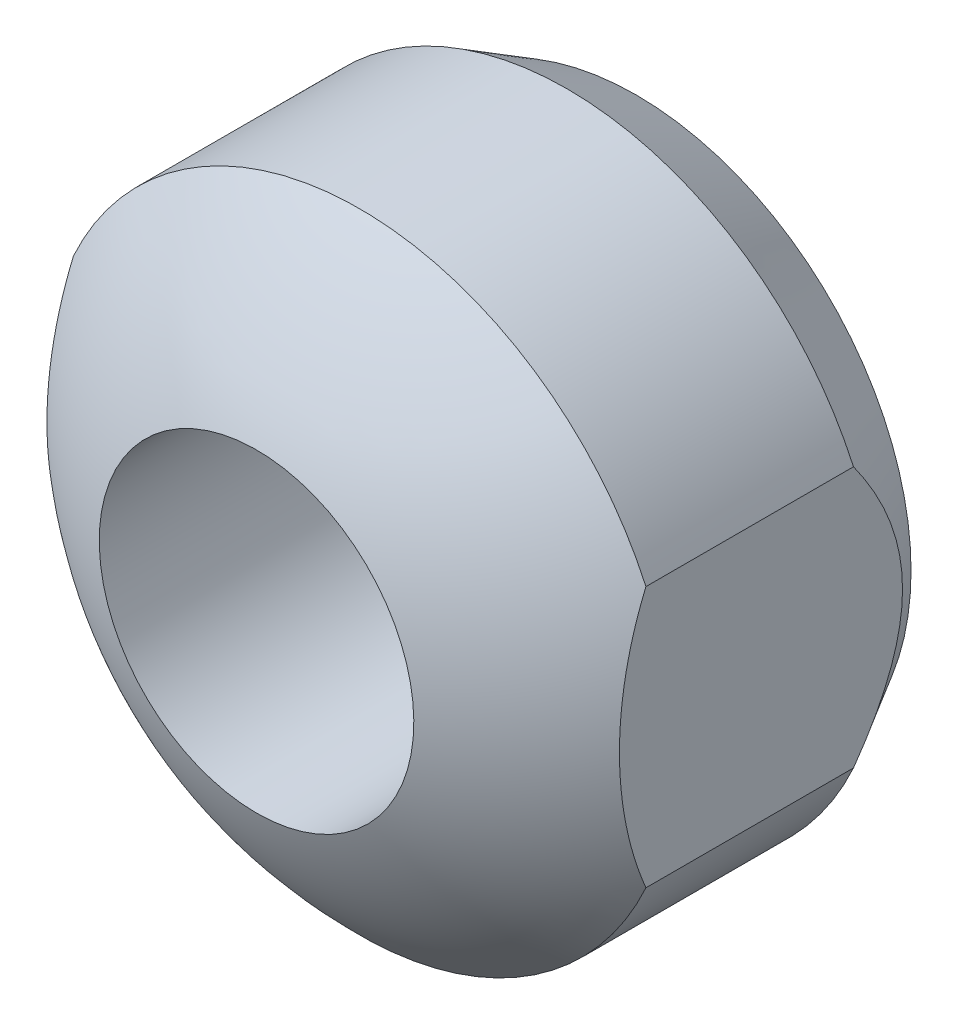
ISO-10303-21;
HEADER;
FILE_DESCRIPTION(('STEP AP214'),'2;1');
FILE_NAME('part.step','',(''),(''),'','','');
FILE_SCHEMA(('AUTOMOTIVE_DESIGN { 1 0 10303 214 1 1 1 1 }'));
ENDSEC;
DATA;
#1=APPLICATION_CONTEXT('core data for automotive mechanical design processes');
#2=APPLICATION_PROTOCOL_DEFINITION('international standard','automotive_design',2000,#1);
#3=PRODUCT_CONTEXT('',#1,'mechanical');
#4=PRODUCT('Part','Part','',(#3));
#5=PRODUCT_RELATED_PRODUCT_CATEGORY('part','',(#4));
#6=PRODUCT_DEFINITION_FORMATION('','',#4);
#7=PRODUCT_DEFINITION_CONTEXT('part definition',#1,'design');
#8=PRODUCT_DEFINITION('design','',#6,#7);
#9=PRODUCT_DEFINITION_SHAPE('','',#8);
#10=(LENGTH_UNIT() NAMED_UNIT(*) SI_UNIT(.MILLI.,.METRE.));
#11=(NAMED_UNIT(*) PLANE_ANGLE_UNIT() SI_UNIT($,.RADIAN.));
#12=(NAMED_UNIT(*) SI_UNIT($,.STERADIAN.) SOLID_ANGLE_UNIT());
#13=UNCERTAINTY_MEASURE_WITH_UNIT(LENGTH_MEASURE(1.E-05),#10,'distance_accuracy_value','');
#14=(GEOMETRIC_REPRESENTATION_CONTEXT(3) GLOBAL_UNCERTAINTY_ASSIGNED_CONTEXT((#13)) GLOBAL_UNIT_ASSIGNED_CONTEXT((#10,
#11,#12)) REPRESENTATION_CONTEXT('',''));
#15=CARTESIAN_POINT('',(0.,0.,0.));
#16=DIRECTION('',(0.,0.,1.));
#17=DIRECTION('',(1.,0.,0.));
#18=AXIS2_PLACEMENT_3D('',#15,#16,#17);
#19=CARTESIAN_POINT('',(-9.27383170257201E-12,0.,-0.999999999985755));
#20=DIRECTION('',(0.,0.,1.));
#21=DIRECTION('',(-1.,0.,0.));
#22=AXIS2_PLACEMENT_3D('',#19,#20,#21);
#23=SPHERICAL_SURFACE('',#22,13.9999999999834);
#24=CARTESIAN_POINT('',(9.1,0.,-0.999999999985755));
#25=DIRECTION('',(-1.,0.,0.));
#26=DIRECTION('',(0.,-1.,0.));
#27=AXIS2_PLACEMENT_3D('',#24,#25,#26);
#28=CIRCLE('',#27,10.6390789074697);
#29=CARTESIAN_POINT('',(9.1,4.14608248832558,8.7979589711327));
#30=VERTEX_POINT('',#29);
#31=CARTESIAN_POINT('',(9.1,-4.14608248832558,8.7979589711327));
#32=VERTEX_POINT('',#31);
#33=EDGE_CURVE('E113',#30,#32,#28,.F.);
#34=ORIENTED_EDGE('',*,*,#33,.F.);
#35=CARTESIAN_POINT('',(0.,0.,8.7979589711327));
#36=DIRECTION('',(0.,0.,1.));
#37=DIRECTION('',(0.,1.,0.));
#38=AXIS2_PLACEMENT_3D('',#35,#36,#37);
#39=CIRCLE('',#38,10.);
#40=CARTESIAN_POINT('',(-9.1,4.14608248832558,8.7979589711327));
#41=VERTEX_POINT('',#40);
#42=EDGE_CURVE('E72',#30,#41,#39,.T.);
#43=ORIENTED_EDGE('',*,*,#42,.T.);
#44=CARTESIAN_POINT('',(-9.1,0.,-0.999999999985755));
#45=DIRECTION('',(1.,0.,0.));
#46=DIRECTION('',(0.,1.,0.));
#47=AXIS2_PLACEMENT_3D('',#44,#45,#46);
#48=CIRCLE('',#47,10.6390789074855);
#49=CARTESIAN_POINT('',(-9.1,-4.14608248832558,8.7979589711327));
#50=VERTEX_POINT('',#49);
#51=EDGE_CURVE('E80',#50,#41,#48,.F.);
#52=ORIENTED_EDGE('',*,*,#51,.F.);
#53=EDGE_CURVE('E84',#50,#32,#39,.T.);
#54=ORIENTED_EDGE('',*,*,#53,.T.);
#55=EDGE_LOOP('',(#34,#43,#52,#54));
#56=FACE_BOUND('',#55,.T.);
#57=CARTESIAN_POINT('',(0.,0.,12.0766968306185));
#58=DIRECTION('',(0.,0.,-1.));
#59=DIRECTION('',(0.,-1.,0.));
#60=AXIS2_PLACEMENT_3D('',#57,#58,#59);
#61=CIRCLE('',#60,5.);
#62=CARTESIAN_POINT('',(0.,-5.,12.0766968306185));
#63=VERTEX_POINT('',#62);
#64=EDGE_CURVE('E73',#63,#63,#61,.T.);
#65=ORIENTED_EDGE('',*,*,#64,.T.);
#66=EDGE_LOOP('',(#65));
#67=FACE_BOUND('',#66,.T.);
#68=ADVANCED_FACE('F14',(#56,#67),#23,.T.);
#69=CARTESIAN_POINT('',(0.,0.,0.));
#70=DIRECTION('',(0.,0.,1.));
#71=DIRECTION('',(0.,1.,0.));
#72=AXIS2_PLACEMENT_3D('',#69,#70,#71);
#73=CYLINDRICAL_SURFACE('',#72,10.);
#74=ORIENTED_EDGE('',*,*,#42,.F.);
#75=DIRECTION('',(0.,0.,1.));
#76=VECTOR('',#75,1.);
#77=CARTESIAN_POINT('',(9.1,4.14608248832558,0.));
#78=LINE('',#77,#76);
#79=CARTESIAN_POINT('',(9.1,4.14608248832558,2.2));
#80=VERTEX_POINT('',#79);
#81=EDGE_CURVE('E60',#30,#80,#78,.F.);
#82=ORIENTED_EDGE('',*,*,#81,.T.);
#83=CARTESIAN_POINT('',(0.,0.,2.2));
#84=DIRECTION('',(0.,0.,1.));
#85=DIRECTION('',(0.,1.,0.));
#86=AXIS2_PLACEMENT_3D('',#83,#84,#85);
#87=CIRCLE('',#86,10.);
#88=CARTESIAN_POINT('',(-9.1,4.14608248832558,2.2));
#89=VERTEX_POINT('',#88);
#90=EDGE_CURVE('E71',#80,#89,#87,.T.);
#91=ORIENTED_EDGE('',*,*,#90,.T.);
#92=DIRECTION('',(0.,0.,1.));
#93=VECTOR('',#92,1.);
#94=CARTESIAN_POINT('',(-9.1,4.14608248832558,0.));
#95=LINE('',#94,#93);
#96=EDGE_CURVE('E116',#89,#41,#95,.T.);
#97=ORIENTED_EDGE('',*,*,#96,.T.);
#98=EDGE_LOOP('',(#74,#82,#91,#97));
#99=FACE_BOUND('',#98,.T.);
#100=ADVANCED_FACE('F69',(#99),#73,.T.);
#101=CARTESIAN_POINT('',(0.,0.,2.2));
#102=DIRECTION('',(0.,0.,1.));
#103=DIRECTION('',(0.,1.,0.));
#104=AXIS2_PLACEMENT_3D('',#101,#102,#103);
#105=CONICAL_SURFACE('',#104,10.,0.523598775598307);
#106=CARTESIAN_POINT('',(0.,0.,0.));
#107=DIRECTION('',(0.,0.,1.));
#108=DIRECTION('',(0.,1.,0.));
#109=AXIS2_PLACEMENT_3D('',#106,#107,#108);
#110=CIRCLE('',#109,8.7298294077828);
#111=CARTESIAN_POINT('',(0.,8.7298294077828,0.));
#112=VERTEX_POINT('',#111);
#113=EDGE_CURVE('E77',#112,#112,#110,.T.);
#114=ORIENTED_EDGE('',*,*,#113,.T.);
#115=EDGE_LOOP('',(#114));
#116=FACE_BOUND('',#115,.T.);
#117=ORIENTED_EDGE('',*,*,#90,.F.);
#118=CARTESIAN_POINT('',(9.1,-7.1979788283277,4.97582735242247));
#119=CARTESIAN_POINT('',(9.1,-7.05743173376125,4.82483148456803));
#120=CARTESIAN_POINT('',(9.1,-6.91554347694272,4.67506687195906));
#121=CARTESIAN_POINT('',(9.1,-6.62869872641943,4.37843937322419));
#122=CARTESIAN_POINT('',(9.1,-6.48374151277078,4.2315771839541));
#123=CARTESIAN_POINT('',(9.1,-6.18955584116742,3.94039140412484));
#124=CARTESIAN_POINT('',(9.1,-6.04030691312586,3.79608843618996));
#125=CARTESIAN_POINT('',(9.1,-5.73796825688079,3.51157445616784));
#126=CARTESIAN_POINT('',(9.1,-5.58487878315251,3.37136317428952));
#127=CARTESIAN_POINT('',(9.1,-5.2682769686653,3.09038468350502));
#128=CARTESIAN_POINT('',(9.1,-5.10459141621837,2.94981193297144));
#129=CARTESIAN_POINT('',(9.1,-4.77197167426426,2.67502608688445));
#130=CARTESIAN_POINT('',(9.1,-4.60303800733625,2.54081236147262));
#131=CARTESIAN_POINT('',(9.1,-4.25965810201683,2.2804324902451));
#132=CARTESIAN_POINT('',(9.1,-4.08522534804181,2.15424864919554));
#133=CARTESIAN_POINT('',(9.1,-3.72988006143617,1.91140536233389));
#134=CARTESIAN_POINT('',(9.1,-3.54896951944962,1.79474302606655));
#135=CARTESIAN_POINT('',(9.1,-3.2022075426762,1.58646370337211));
#136=CARTESIAN_POINT('',(9.1,-3.03715599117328,1.49352140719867));
#137=CARTESIAN_POINT('',(9.1,-2.70126523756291,1.31857779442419));
#138=CARTESIAN_POINT('',(9.1,-2.53042496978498,1.23657850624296));
#139=CARTESIAN_POINT('',(9.1,-2.18438020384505,1.08631416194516));
#140=CARTESIAN_POINT('',(9.1,-2.00922145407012,1.0179446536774));
#141=CARTESIAN_POINT('',(9.1,-1.65370782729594,0.896461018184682));
#142=CARTESIAN_POINT('',(9.1,-1.47335540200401,0.843339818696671));
#143=CARTESIAN_POINT('',(9.1,-1.14268907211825,0.762898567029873));
#144=CARTESIAN_POINT('',(9.1,-0.993098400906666,0.732606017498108));
#145=CARTESIAN_POINT('',(9.1,-0.691914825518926,0.684517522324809));
#146=CARTESIAN_POINT('',(9.1,-0.540322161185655,0.66672009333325));
#147=CARTESIAN_POINT('',(9.1,-0.23611975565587,0.644261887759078));
#148=CARTESIAN_POINT('',(9.1,-0.0835097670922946,0.639604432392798));
#149=CARTESIAN_POINT('',(9.1,0.221537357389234,0.643610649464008));
#150=CARTESIAN_POINT('',(9.1,0.373974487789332,0.65227473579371));
#151=CARTESIAN_POINT('',(9.1,0.677103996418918,0.68255901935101));
#152=CARTESIAN_POINT('',(9.1,0.827800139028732,0.70414177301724));
#153=CARTESIAN_POINT('',(9.1,1.12690544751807,0.759457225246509));
#154=CARTESIAN_POINT('',(9.1,1.27531458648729,0.793190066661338));
#155=CARTESIAN_POINT('',(9.1,1.71618071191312,0.911128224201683));
#156=CARTESIAN_POINT('',(9.1,2.00424617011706,1.01206980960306));
#157=CARTESIAN_POINT('',(9.1,2.52862660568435,1.23317747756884));
#158=CARTESIAN_POINT('',(9.1,2.76679523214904,1.34912747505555));
#159=CARTESIAN_POINT('',(9.1,3.23219899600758,1.60147874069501));
#160=CARTESIAN_POINT('',(9.1,3.45942483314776,1.73789701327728));
#161=CARTESIAN_POINT('',(9.1,3.90550691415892,2.02765454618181));
#162=CARTESIAN_POINT('',(9.1,4.12427295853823,2.18113091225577));
#163=CARTESIAN_POINT('',(9.1,4.55249080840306,2.50031974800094));
#164=CARTESIAN_POINT('',(9.1,4.76194590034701,2.66602784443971));
#165=CARTESIAN_POINT('',(9.1,5.19290153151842,3.02366746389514));
#166=CARTESIAN_POINT('',(9.1,5.41358321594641,3.21658005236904));
#167=CARTESIAN_POINT('',(9.1,5.84680486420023,3.61138030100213));
#168=CARTESIAN_POINT('',(9.1,6.05934297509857,3.81326998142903));
#169=CARTESIAN_POINT('',(9.1,6.47776996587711,4.2243972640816));
#170=CARTESIAN_POINT('',(9.1,6.6836486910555,4.43364515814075));
#171=CARTESIAN_POINT('',(9.1,7.08947681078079,4.85781847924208));
#172=CARTESIAN_POINT('',(9.1,7.28942585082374,5.07274424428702));
#173=CARTESIAN_POINT('',(9.1,7.67589095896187,5.49802704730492));
#174=CARTESIAN_POINT('',(9.1,7.86261760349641,5.70819328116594));
#175=CARTESIAN_POINT('',(9.1,8.23202948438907,6.13205711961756));
#176=CARTESIAN_POINT('',(9.1,8.41471455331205,6.34575486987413));
#177=CARTESIAN_POINT('',(9.1,8.77586706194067,6.77528945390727));
#178=CARTESIAN_POINT('',(9.1,8.95434792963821,6.99111502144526));
#179=CARTESIAN_POINT('',(9.1,9.30820074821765,7.42525402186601));
#180=CARTESIAN_POINT('',(9.1,9.48357310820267,7.64356712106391));
#181=CARTESIAN_POINT('',(9.1,9.65761072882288,7.86292802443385));
#182=B_SPLINE_CURVE_WITH_KNOTS('',3,(#118,#119,#120,#121,#122,#123,#124,#125,#126,#127,#128,
#129,#130,#131,#132,#133,#134,#135,#136,#137,#138,#139,#140,#141,#142,#143,#144,#145,#146,#147,
#148,#149,#150,#151,#152,#153,#154,#155,#156,#157,#158,#159,#160,#161,#162,#163,#164,#165,#166,
#167,#168,#169,#170,#171,#172,#173,#174,#175,#176,#177,#178,#179,#180,#181),.UNSPECIFIED.,.F.,
.F.,(4,2,2,2,2,2,2,2,2,2,2,2,2,2,2,2,2,2,2,2,2,2,2,2,2,2,2,2,2,2,2,4),(0.,0.618863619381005,
1.23787406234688,1.86061352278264,2.48331182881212,3.1304673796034,3.77755869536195,
4.42317077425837,5.06858612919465,5.63650922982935,6.20453745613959,6.76802940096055,
7.33125957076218,7.78866066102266,8.24600744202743,8.70346981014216,9.16094639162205,
9.61710339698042,10.0732657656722,10.9856807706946,11.7792614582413,12.5735051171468,
13.3746706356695,14.1755510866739,15.0545772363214,15.9338022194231,16.8143101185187,
17.694870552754,18.5382158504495,19.3815960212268,20.2217597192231,21.0618120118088),.UNSPECIFIED.);
#183=CARTESIAN_POINT('',(9.1,-4.14608248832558,2.2));
#184=VERTEX_POINT('',#183);
#185=EDGE_CURVE('E9',#184,#80,#182,.T.);
#186=ORIENTED_EDGE('',*,*,#185,.F.);
#187=CARTESIAN_POINT('',(-9.1,-4.14608248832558,2.2));
#188=VERTEX_POINT('',#187);
#189=EDGE_CURVE('E76',#188,#184,#87,.T.);
#190=ORIENTED_EDGE('',*,*,#189,.F.);
#191=CARTESIAN_POINT('',(-9.1,-7.1979788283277,4.97582735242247));
#192=CARTESIAN_POINT('',(-9.1,-7.05743173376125,4.82483148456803));
#193=CARTESIAN_POINT('',(-9.1,-6.91554347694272,4.67506687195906));
#194=CARTESIAN_POINT('',(-9.1,-6.62869872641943,4.37843937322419));
#195=CARTESIAN_POINT('',(-9.1,-6.48374151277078,4.2315771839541));
#196=CARTESIAN_POINT('',(-9.1,-6.18955584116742,3.94039140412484));
#197=CARTESIAN_POINT('',(-9.1,-6.04030691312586,3.79608843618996));
#198=CARTESIAN_POINT('',(-9.1,-5.73796825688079,3.51157445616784));
#199=CARTESIAN_POINT('',(-9.1,-5.58487878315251,3.37136317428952));
#200=CARTESIAN_POINT('',(-9.1,-5.2682769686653,3.09038468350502));
#201=CARTESIAN_POINT('',(-9.1,-5.10459141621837,2.94981193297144));
#202=CARTESIAN_POINT('',(-9.1,-4.77197167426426,2.67502608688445));
#203=CARTESIAN_POINT('',(-9.1,-4.60303800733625,2.54081236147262));
#204=CARTESIAN_POINT('',(-9.1,-4.25965810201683,2.2804324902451));
#205=CARTESIAN_POINT('',(-9.1,-4.08522534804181,2.15424864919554));
#206=CARTESIAN_POINT('',(-9.1,-3.72988006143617,1.91140536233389));
#207=CARTESIAN_POINT('',(-9.1,-3.54896951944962,1.79474302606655));
#208=CARTESIAN_POINT('',(-9.1,-3.2022075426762,1.58646370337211));
#209=CARTESIAN_POINT('',(-9.1,-3.03715599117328,1.49352140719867));
#210=CARTESIAN_POINT('',(-9.1,-2.70126523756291,1.31857779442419));
#211=CARTESIAN_POINT('',(-9.1,-2.53042496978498,1.23657850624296));
#212=CARTESIAN_POINT('',(-9.1,-2.18438020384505,1.08631416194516));
#213=CARTESIAN_POINT('',(-9.1,-2.00922145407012,1.0179446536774));
#214=CARTESIAN_POINT('',(-9.1,-1.65370782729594,0.896461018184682));
#215=CARTESIAN_POINT('',(-9.1,-1.47335540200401,0.843339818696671));
#216=CARTESIAN_POINT('',(-9.1,-1.14268907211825,0.762898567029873));
#217=CARTESIAN_POINT('',(-9.1,-0.993098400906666,0.732606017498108));
#218=CARTESIAN_POINT('',(-9.1,-0.691914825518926,0.684517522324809));
#219=CARTESIAN_POINT('',(-9.1,-0.540322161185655,0.66672009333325));
#220=CARTESIAN_POINT('',(-9.1,-0.23611975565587,0.644261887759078));
#221=CARTESIAN_POINT('',(-9.1,-0.0835097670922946,0.639604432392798));
#222=CARTESIAN_POINT('',(-9.1,0.221537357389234,0.643610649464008));
#223=CARTESIAN_POINT('',(-9.1,0.373974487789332,0.65227473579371));
#224=CARTESIAN_POINT('',(-9.1,0.677103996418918,0.68255901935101));
#225=CARTESIAN_POINT('',(-9.1,0.827800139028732,0.70414177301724));
#226=CARTESIAN_POINT('',(-9.1,1.12690544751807,0.759457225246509));
#227=CARTESIAN_POINT('',(-9.1,1.27531458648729,0.793190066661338));
#228=CARTESIAN_POINT('',(-9.1,1.71618071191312,0.911128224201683));
#229=CARTESIAN_POINT('',(-9.1,2.00424617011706,1.01206980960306));
#230=CARTESIAN_POINT('',(-9.1,2.52862660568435,1.23317747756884));
#231=CARTESIAN_POINT('',(-9.1,2.76679523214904,1.34912747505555));
#232=CARTESIAN_POINT('',(-9.1,3.23219899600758,1.60147874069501));
#233=CARTESIAN_POINT('',(-9.1,3.45942483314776,1.73789701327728));
#234=CARTESIAN_POINT('',(-9.1,3.90550691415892,2.02765454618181));
#235=CARTESIAN_POINT('',(-9.1,4.12427295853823,2.18113091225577));
#236=CARTESIAN_POINT('',(-9.1,4.55249080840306,2.50031974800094));
#237=CARTESIAN_POINT('',(-9.1,4.76194590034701,2.66602784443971));
#238=CARTESIAN_POINT('',(-9.1,5.19290153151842,3.02366746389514));
#239=CARTESIAN_POINT('',(-9.1,5.41358321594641,3.21658005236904));
#240=CARTESIAN_POINT('',(-9.1,5.84680486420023,3.61138030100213));
#241=CARTESIAN_POINT('',(-9.1,6.05934297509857,3.81326998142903));
#242=CARTESIAN_POINT('',(-9.1,6.47776996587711,4.2243972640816));
#243=CARTESIAN_POINT('',(-9.1,6.6836486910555,4.43364515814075));
#244=CARTESIAN_POINT('',(-9.1,7.08947681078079,4.85781847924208));
#245=CARTESIAN_POINT('',(-9.1,7.28942585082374,5.07274424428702));
#246=CARTESIAN_POINT('',(-9.1,7.67589095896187,5.49802704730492));
#247=CARTESIAN_POINT('',(-9.1,7.86261760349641,5.70819328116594));
#248=CARTESIAN_POINT('',(-9.1,8.23202948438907,6.13205711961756));
#249=CARTESIAN_POINT('',(-9.1,8.41471455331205,6.34575486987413));
#250=CARTESIAN_POINT('',(-9.1,8.77586706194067,6.77528945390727));
#251=CARTESIAN_POINT('',(-9.1,8.95434792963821,6.99111502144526));
#252=CARTESIAN_POINT('',(-9.1,9.30820074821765,7.42525402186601));
#253=CARTESIAN_POINT('',(-9.1,9.48357310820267,7.64356712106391));
#254=CARTESIAN_POINT('',(-9.1,9.65761072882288,7.86292802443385));
#255=B_SPLINE_CURVE_WITH_KNOTS('',3,(#191,#192,#193,#194,#195,#196,#197,#198,#199,#200,#201,
#202,#203,#204,#205,#206,#207,#208,#209,#210,#211,#212,#213,#214,#215,#216,#217,#218,#219,#220,
#221,#222,#223,#224,#225,#226,#227,#228,#229,#230,#231,#232,#233,#234,#235,#236,#237,#238,#239,
#240,#241,#242,#243,#244,#245,#246,#247,#248,#249,#250,#251,#252,#253,#254),.UNSPECIFIED.,.F.,
.F.,(4,2,2,2,2,2,2,2,2,2,2,2,2,2,2,2,2,2,2,2,2,2,2,2,2,2,2,2,2,2,2,4),(0.,0.618863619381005,
1.23787406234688,1.86061352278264,2.48331182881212,3.1304673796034,3.77755869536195,
4.42317077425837,5.06858612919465,5.63650922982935,6.20453745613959,6.76802940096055,
7.33125957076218,7.78866066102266,8.24600744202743,8.70346981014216,9.16094639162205,
9.61710339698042,10.0732657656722,10.9856807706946,11.7792614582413,12.5735051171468,
13.3746706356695,14.1755510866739,15.0545772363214,15.9338022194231,16.8143101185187,
17.694870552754,18.5382158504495,19.3815960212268,20.2217597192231,21.0618120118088),.UNSPECIFIED.);
#256=EDGE_CURVE('E27',#89,#188,#255,.F.);
#257=ORIENTED_EDGE('',*,*,#256,.F.);
#258=EDGE_LOOP('',(#117,#186,#190,#257));
#259=FACE_BOUND('',#258,.T.);
#260=ADVANCED_FACE('F75',(#116,#259),#105,.T.);
#261=DIRECTION('',(0.,0.,1.));
#262=VECTOR('',#261,1.);
#263=CARTESIAN_POINT('',(9.1,-4.14608248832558,0.));
#264=LINE('',#263,#262);
#265=EDGE_CURVE('E63',#32,#184,#264,.F.);
#266=ORIENTED_EDGE('',*,*,#265,.F.);
#267=ORIENTED_EDGE('',*,*,#53,.F.);
#268=DIRECTION('',(0.,0.,1.));
#269=VECTOR('',#268,1.);
#270=CARTESIAN_POINT('',(-9.1,-4.14608248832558,0.));
#271=LINE('',#270,#269);
#272=EDGE_CURVE('E34',#188,#50,#271,.T.);
#273=ORIENTED_EDGE('',*,*,#272,.F.);
#274=ORIENTED_EDGE('',*,*,#189,.T.);
#275=EDGE_LOOP('',(#266,#267,#273,#274));
#276=FACE_BOUND('',#275,.T.);
#277=ADVANCED_FACE('F96',(#276),#73,.T.);
#278=CARTESIAN_POINT('',(-8.7298294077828,0.,0.));
#279=DIRECTION('',(0.,0.,-1.));
#280=DIRECTION('',(0.,-1.,0.));
#281=AXIS2_PLACEMENT_3D('',#278,#279,#280);
#282=PLANE('',#281);
#283=CARTESIAN_POINT('',(0.,0.,0.));
#284=DIRECTION('',(0.,0.,1.));
#285=DIRECTION('',(0.,1.,0.));
#286=AXIS2_PLACEMENT_3D('',#283,#284,#285);
#287=CIRCLE('',#286,5.);
#288=CARTESIAN_POINT('',(0.,5.,0.));
#289=VERTEX_POINT('',#288);
#290=EDGE_CURVE('E123',#289,#289,#287,.T.);
#291=ORIENTED_EDGE('',*,*,#290,.T.);
#292=EDGE_LOOP('',(#291));
#293=FACE_BOUND('',#292,.T.);
#294=ORIENTED_EDGE('',*,*,#113,.F.);
#295=EDGE_LOOP('',(#294));
#296=FACE_BOUND('',#295,.T.);
#297=ADVANCED_FACE('F98',(#293,#296),#282,.T.);
#298=CARTESIAN_POINT('',(-9.1,-10.,12.1));
#299=DIRECTION('',(1.,0.,0.));
#300=DIRECTION('',(0.,1.,0.));
#301=AXIS2_PLACEMENT_3D('',#298,#299,#300);
#302=PLANE('',#301);
#303=ORIENTED_EDGE('',*,*,#51,.T.);
#304=ORIENTED_EDGE('',*,*,#96,.F.);
#305=ORIENTED_EDGE('',*,*,#256,.T.);
#306=ORIENTED_EDGE('',*,*,#272,.T.);
#307=EDGE_LOOP('',(#303,#304,#305,#306));
#308=FACE_BOUND('',#307,.T.);
#309=ADVANCED_FACE('F91',(#308),#302,.F.);
#310=CARTESIAN_POINT('',(9.1,-10.,0.));
#311=DIRECTION('',(-1.,0.,0.));
#312=DIRECTION('',(0.,-1.,0.));
#313=AXIS2_PLACEMENT_3D('',#310,#311,#312);
#314=PLANE('',#313);
#315=ORIENTED_EDGE('',*,*,#33,.T.);
#316=ORIENTED_EDGE('',*,*,#265,.T.);
#317=ORIENTED_EDGE('',*,*,#185,.T.);
#318=ORIENTED_EDGE('',*,*,#81,.F.);
#319=EDGE_LOOP('',(#315,#316,#317,#318));
#320=FACE_BOUND('',#319,.T.);
#321=ADVANCED_FACE('F59',(#320),#314,.F.);
#322=CARTESIAN_POINT('',(0.,0.,12.0831334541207));
#323=DIRECTION('',(0.,0.,-1.));
#324=DIRECTION('',(0.,-1.,0.));
#325=AXIS2_PLACEMENT_3D('',#322,#323,#324);
#326=CYLINDRICAL_SURFACE('',#325,5.);
#327=ORIENTED_EDGE('',*,*,#64,.F.);
#328=EDGE_LOOP('',(#327));
#329=FACE_BOUND('',#328,.T.);
#330=ORIENTED_EDGE('',*,*,#290,.F.);
#331=EDGE_LOOP('',(#330));
#332=FACE_BOUND('',#331,.T.);
#333=ADVANCED_FACE('F128',(#329,#332),#326,.F.);
#334=CLOSED_SHELL('',(#68,#100,#260,#277,#297,#309,#321,#333));
#335=MANIFOLD_SOLID_BREP('B1',#334);
#336=ADVANCED_BREP_SHAPE_REPRESENTATION('',(#18,#335),#14);
#337=SHAPE_DEFINITION_REPRESENTATION(#9,#336);
ENDSEC;
END-ISO-10303-21;
